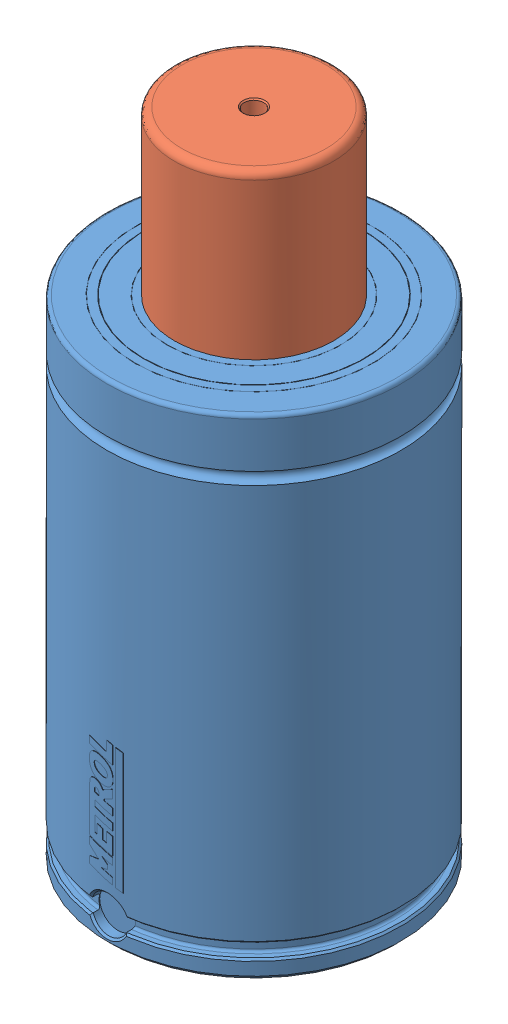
SolidWorks assembly ISNG5000-063.SLDASM, configuration Default (file format 7000). Lengths in mm.
Overall size (120 267 120.11).
2 component instances, 2 part files, 5 mates.
Components (placement in the parent):
- ISNG-5000 Body-1: ISNG-5000 Body.SLDPRT [ISNG-5000-63.5] x (0 0 1) z (0 -1 0) size (120.11 120 200.5)
- ISNG-5000 Piston-1: ISNG-5000 Piston.SLDPRT [ISNG-5000-63.5] at (0 175.5 0) x (0.975403 0 0.220427) z (0 -1 0) size (85 85 91.5)
Mates (geometry in assembly coordinates):
- Concentric1: concentric aligned: cylinder of ISNG-5000 Body-1 through (0 0 0) axis (0 -1 0) radius 32.5; cylinder of ISNG-5000 Piston-1 through (0 175.5 0) axis (0 -1 0) radius 32.5
- LimitDistance1: limit distance anti-aligned: plane of ISNG-5000 Piston-1 through (-9.3682 180.5 41.4546) normal (0 1 0); plane of ISNG-5000 Body-1 through (-32.5 180.5 0) normal (0 -1 0)
- Coincident1: coincident anti-aligned: plane of ISNG-5000 Body-1 through (0 0 0) normal (0 -1 0); plane of assembly through (0 0 0) normal (0 1 0)
- Coincident2: coincident anti-aligned: plane of ISNG-5000 Body-1; plane of assembly through (0 0 0) normal (1 0 0)
- Coincident4: coincident aligned: plane of ISNG-5000 Body-1; plane of assembly through (0 0 0) normal (0 0 1)
